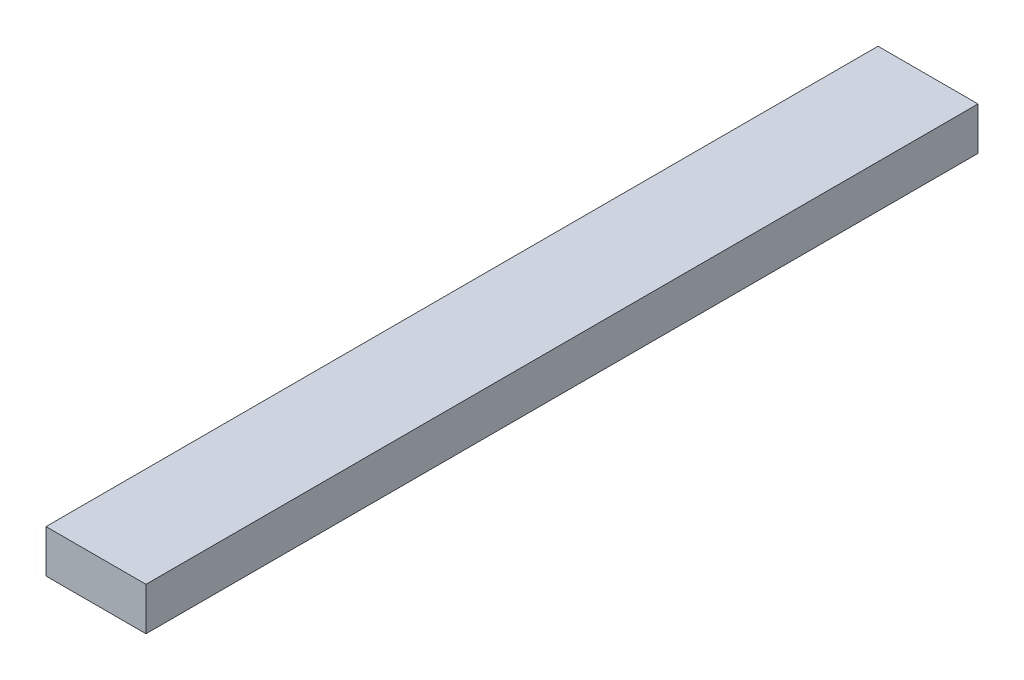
ISO-10303-21;
HEADER;
FILE_DESCRIPTION(('STEP AP214'),'2;1');
FILE_NAME('part.step','',(''),(''),'','','');
FILE_SCHEMA(('AUTOMOTIVE_DESIGN { 1 0 10303 214 1 1 1 1 }'));
ENDSEC;
DATA;
#1=APPLICATION_CONTEXT('core data for automotive mechanical design processes');
#2=APPLICATION_PROTOCOL_DEFINITION('international standard','automotive_design',2000,#1);
#3=PRODUCT_CONTEXT('',#1,'mechanical');
#4=PRODUCT('Part','Part','',(#3));
#5=PRODUCT_RELATED_PRODUCT_CATEGORY('part','',(#4));
#6=PRODUCT_DEFINITION_FORMATION('','',#4);
#7=PRODUCT_DEFINITION_CONTEXT('part definition',#1,'design');
#8=PRODUCT_DEFINITION('design','',#6,#7);
#9=PRODUCT_DEFINITION_SHAPE('','',#8);
#10=(LENGTH_UNIT() NAMED_UNIT(*) SI_UNIT(.MILLI.,.METRE.));
#11=(NAMED_UNIT(*) PLANE_ANGLE_UNIT() SI_UNIT($,.RADIAN.));
#12=(NAMED_UNIT(*) SI_UNIT($,.STERADIAN.) SOLID_ANGLE_UNIT());
#13=UNCERTAINTY_MEASURE_WITH_UNIT(LENGTH_MEASURE(1.E-05),#10,'distance_accuracy_value','');
#14=(GEOMETRIC_REPRESENTATION_CONTEXT(3) GLOBAL_UNCERTAINTY_ASSIGNED_CONTEXT((#13)) GLOBAL_UNIT_ASSIGNED_CONTEXT((#10,
#11,#12)) REPRESENTATION_CONTEXT('',''));
#15=CARTESIAN_POINT('',(0.,0.,0.));
#16=DIRECTION('',(0.,0.,1.));
#17=DIRECTION('',(1.,0.,0.));
#18=AXIS2_PLACEMENT_3D('',#15,#16,#17);
#19=CARTESIAN_POINT('',(-88.9,38.1,0.));
#20=DIRECTION('',(0.,0.,1.));
#21=DIRECTION('',(1.,0.,0.));
#22=AXIS2_PLACEMENT_3D('',#19,#20,#21);
#23=PLANE('',#22);
#24=DIRECTION('',(-1.,0.,0.));
#25=VECTOR('',#24,1.);
#26=CARTESIAN_POINT('',(-88.9,0.,0.));
#27=LINE('',#26,#25);
#28=CARTESIAN_POINT('',(0.,0.,0.));
#29=VERTEX_POINT('',#28);
#30=CARTESIAN_POINT('',(-88.9,0.,0.));
#31=VERTEX_POINT('',#30);
#32=EDGE_CURVE('E96',#29,#31,#27,.T.);
#33=ORIENTED_EDGE('',*,*,#32,.T.);
#34=DIRECTION('',(0.,-1.,0.));
#35=VECTOR('',#34,1.);
#36=CARTESIAN_POINT('',(-88.9,38.1,0.));
#37=LINE('',#36,#35);
#38=CARTESIAN_POINT('',(-88.9,38.1,0.));
#39=VERTEX_POINT('',#38);
#40=EDGE_CURVE('E11',#39,#31,#37,.T.);
#41=ORIENTED_EDGE('',*,*,#40,.F.);
#42=DIRECTION('',(-1.,0.,0.));
#43=VECTOR('',#42,1.);
#44=CARTESIAN_POINT('',(-88.9,38.1,0.));
#45=LINE('',#44,#43);
#46=CARTESIAN_POINT('',(0.,38.1,0.));
#47=VERTEX_POINT('',#46);
#48=EDGE_CURVE('E84',#47,#39,#45,.T.);
#49=ORIENTED_EDGE('',*,*,#48,.F.);
#50=DIRECTION('',(0.,-1.,0.));
#51=VECTOR('',#50,1.);
#52=CARTESIAN_POINT('',(0.,38.1,0.));
#53=LINE('',#52,#51);
#54=EDGE_CURVE('E92',#47,#29,#53,.T.);
#55=ORIENTED_EDGE('',*,*,#54,.T.);
#56=EDGE_LOOP('',(#33,#41,#49,#55));
#57=FACE_BOUND('',#56,.T.);
#58=ADVANCED_FACE('F33',(#57),#23,.F.);
#59=CARTESIAN_POINT('',(-88.9,38.1,739.775));
#60=DIRECTION('',(1.,0.,0.));
#61=DIRECTION('',(0.,0.,-1.));
#62=AXIS2_PLACEMENT_3D('',#59,#60,#61);
#63=PLANE('',#62);
#64=DIRECTION('',(0.,0.,1.));
#65=VECTOR('',#64,1.);
#66=CARTESIAN_POINT('',(-88.9,0.,739.775));
#67=LINE('',#66,#65);
#68=CARTESIAN_POINT('',(-88.9,0.,739.775));
#69=VERTEX_POINT('',#68);
#70=EDGE_CURVE('E88',#31,#69,#67,.T.);
#71=ORIENTED_EDGE('',*,*,#70,.T.);
#72=DIRECTION('',(0.,-1.,0.));
#73=VECTOR('',#72,1.);
#74=CARTESIAN_POINT('',(-88.9,38.1,739.775));
#75=LINE('',#74,#73);
#76=CARTESIAN_POINT('',(-88.9,38.1,739.775));
#77=VERTEX_POINT('',#76);
#78=EDGE_CURVE('E41',#77,#69,#75,.T.);
#79=ORIENTED_EDGE('',*,*,#78,.F.);
#80=DIRECTION('',(0.,0.,1.));
#81=VECTOR('',#80,1.);
#82=CARTESIAN_POINT('',(-88.9,38.1,739.775));
#83=LINE('',#82,#81);
#84=EDGE_CURVE('E79',#39,#77,#83,.T.);
#85=ORIENTED_EDGE('',*,*,#84,.F.);
#86=ORIENTED_EDGE('',*,*,#40,.T.);
#87=EDGE_LOOP('',(#71,#79,#85,#86));
#88=FACE_BOUND('',#87,.T.);
#89=ADVANCED_FACE('F87',(#88),#63,.F.);
#90=CARTESIAN_POINT('',(0.,38.1,739.775));
#91=DIRECTION('',(0.,0.,-1.));
#92=DIRECTION('',(-1.,0.,0.));
#93=AXIS2_PLACEMENT_3D('',#90,#91,#92);
#94=PLANE('',#93);
#95=DIRECTION('',(1.,0.,0.));
#96=VECTOR('',#95,1.);
#97=CARTESIAN_POINT('',(0.,0.,739.775));
#98=LINE('',#97,#96);
#99=CARTESIAN_POINT('',(0.,0.,739.775));
#100=VERTEX_POINT('',#99);
#101=EDGE_CURVE('E66',#69,#100,#98,.T.);
#102=ORIENTED_EDGE('',*,*,#101,.T.);
#103=DIRECTION('',(0.,-1.,0.));
#104=VECTOR('',#103,1.);
#105=CARTESIAN_POINT('',(0.,38.1,739.775));
#106=LINE('',#105,#104);
#107=CARTESIAN_POINT('',(0.,38.1,739.775));
#108=VERTEX_POINT('',#107);
#109=EDGE_CURVE('E89',#108,#100,#106,.T.);
#110=ORIENTED_EDGE('',*,*,#109,.F.);
#111=DIRECTION('',(1.,0.,0.));
#112=VECTOR('',#111,1.);
#113=CARTESIAN_POINT('',(0.,38.1,739.775));
#114=LINE('',#113,#112);
#115=EDGE_CURVE('E82',#77,#108,#114,.T.);
#116=ORIENTED_EDGE('',*,*,#115,.F.);
#117=ORIENTED_EDGE('',*,*,#78,.T.);
#118=EDGE_LOOP('',(#102,#110,#116,#117));
#119=FACE_BOUND('',#118,.T.);
#120=ADVANCED_FACE('F90',(#119),#94,.F.);
#121=CARTESIAN_POINT('',(0.,38.1,0.));
#122=DIRECTION('',(-1.,0.,0.));
#123=DIRECTION('',(0.,0.,1.));
#124=AXIS2_PLACEMENT_3D('',#121,#122,#123);
#125=PLANE('',#124);
#126=DIRECTION('',(0.,0.,-1.));
#127=VECTOR('',#126,1.);
#128=CARTESIAN_POINT('',(0.,0.,0.));
#129=LINE('',#128,#127);
#130=EDGE_CURVE('E72',#100,#29,#129,.T.);
#131=ORIENTED_EDGE('',*,*,#130,.T.);
#132=ORIENTED_EDGE('',*,*,#54,.F.);
#133=DIRECTION('',(0.,0.,-1.));
#134=VECTOR('',#133,1.);
#135=CARTESIAN_POINT('',(0.,38.1,0.));
#136=LINE('',#135,#134);
#137=EDGE_CURVE('E49',#108,#47,#136,.T.);
#138=ORIENTED_EDGE('',*,*,#137,.F.);
#139=ORIENTED_EDGE('',*,*,#109,.T.);
#140=EDGE_LOOP('',(#131,#132,#138,#139));
#141=FACE_BOUND('',#140,.T.);
#142=ADVANCED_FACE('F103',(#141),#125,.F.);
#143=CARTESIAN_POINT('',(0.,38.1,0.));
#144=DIRECTION('',(0.,-1.,0.));
#145=DIRECTION('',(0.,0.,-1.));
#146=AXIS2_PLACEMENT_3D('',#143,#144,#145);
#147=PLANE('',#146);
#148=ORIENTED_EDGE('',*,*,#48,.T.);
#149=ORIENTED_EDGE('',*,*,#84,.T.);
#150=ORIENTED_EDGE('',*,*,#115,.T.);
#151=ORIENTED_EDGE('',*,*,#137,.T.);
#152=EDGE_LOOP('',(#148,#149,#150,#151));
#153=FACE_BOUND('',#152,.T.);
#154=ADVANCED_FACE('F80',(#153),#147,.F.);
#155=CARTESIAN_POINT('',(0.,0.,0.));
#156=DIRECTION('',(0.,-1.,0.));
#157=DIRECTION('',(0.,0.,-1.));
#158=AXIS2_PLACEMENT_3D('',#155,#156,#157);
#159=PLANE('',#158);
#160=ORIENTED_EDGE('',*,*,#32,.F.);
#161=ORIENTED_EDGE('',*,*,#130,.F.);
#162=ORIENTED_EDGE('',*,*,#101,.F.);
#163=ORIENTED_EDGE('',*,*,#70,.F.);
#164=EDGE_LOOP('',(#160,#161,#162,#163));
#165=FACE_BOUND('',#164,.T.);
#166=ADVANCED_FACE('F106',(#165),#159,.T.);
#167=CLOSED_SHELL('',(#58,#89,#120,#142,#154,#166));
#168=MANIFOLD_SOLID_BREP('B2',#167);
#169=ADVANCED_BREP_SHAPE_REPRESENTATION('',(#18,#168),#14);
#170=SHAPE_DEFINITION_REPRESENTATION(#9,#169);
ENDSEC;
END-ISO-10303-21;
